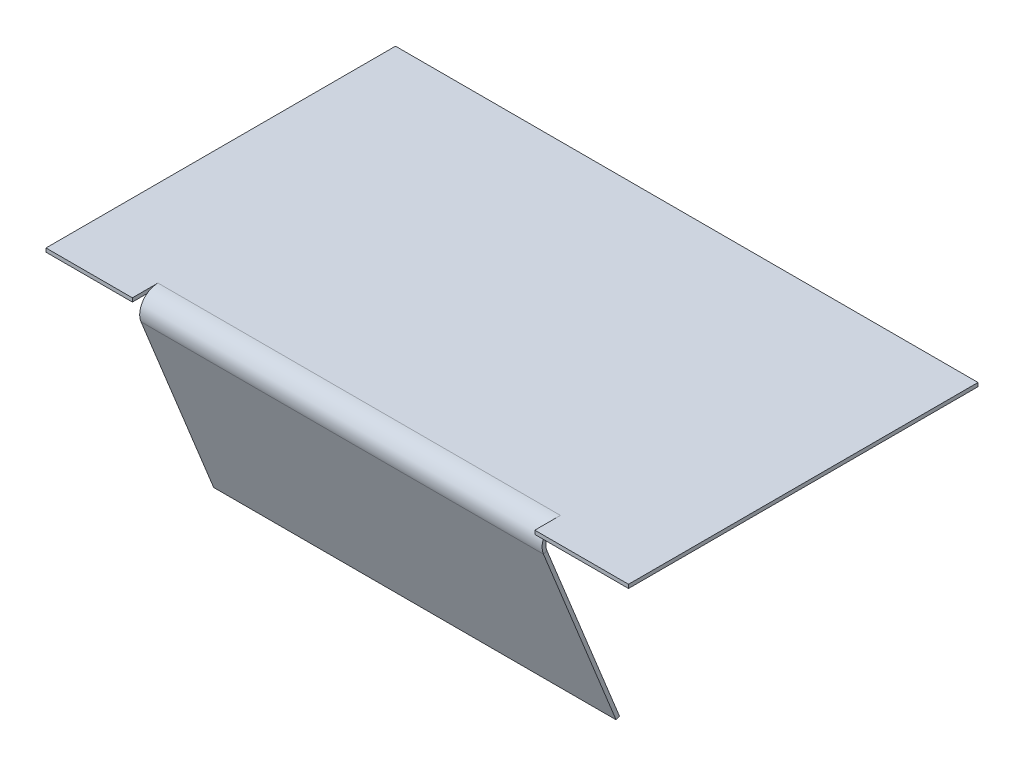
ISO-10303-21;
HEADER;
FILE_DESCRIPTION(('STEP AP214'),'2;1');
FILE_NAME('part.step','',(''),(''),'','','');
FILE_SCHEMA(('AUTOMOTIVE_DESIGN { 1 0 10303 214 1 1 1 1 }'));
ENDSEC;
DATA;
#1=APPLICATION_CONTEXT('core data for automotive mechanical design processes');
#2=APPLICATION_PROTOCOL_DEFINITION('international standard','automotive_design',2000,#1);
#3=PRODUCT_CONTEXT('',#1,'mechanical');
#4=PRODUCT('Part','Part','',(#3));
#5=PRODUCT_RELATED_PRODUCT_CATEGORY('part','',(#4));
#6=PRODUCT_DEFINITION_FORMATION('','',#4);
#7=PRODUCT_DEFINITION_CONTEXT('part definition',#1,'design');
#8=PRODUCT_DEFINITION('design','',#6,#7);
#9=PRODUCT_DEFINITION_SHAPE('','',#8);
#10=(LENGTH_UNIT() NAMED_UNIT(*) SI_UNIT(.MILLI.,.METRE.));
#11=(NAMED_UNIT(*) PLANE_ANGLE_UNIT() SI_UNIT($,.RADIAN.));
#12=(NAMED_UNIT(*) SI_UNIT($,.STERADIAN.) SOLID_ANGLE_UNIT());
#13=UNCERTAINTY_MEASURE_WITH_UNIT(LENGTH_MEASURE(1.E-05),#10,'distance_accuracy_value','');
#14=(GEOMETRIC_REPRESENTATION_CONTEXT(3) GLOBAL_UNCERTAINTY_ASSIGNED_CONTEXT((#13)) GLOBAL_UNIT_ASSIGNED_CONTEXT((#10,
#11,#12)) REPRESENTATION_CONTEXT('',''));
#15=CARTESIAN_POINT('',(0.,0.,0.));
#16=DIRECTION('',(0.,0.,1.));
#17=DIRECTION('',(1.,0.,0.));
#18=AXIS2_PLACEMENT_3D('',#15,#16,#17);
#19=CARTESIAN_POINT('',(29.6570224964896,-1.26999999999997,0.));
#20=DIRECTION('',(1.,0.,0.));
#21=DIRECTION('',(0.,0.,-1.));
#22=AXIS2_PLACEMENT_3D('',#19,#20,#21);
#23=PLANE('',#22);
#24=DIRECTION('',(0.,0.,-1.));
#25=VECTOR('',#24,1.);
#26=CARTESIAN_POINT('',(29.6570224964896,-1.26999999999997,0.));
#27=LINE('',#26,#25);
#28=CARTESIAN_POINT('',(29.6570224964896,-1.27,0.));
#29=VERTEX_POINT('',#28);
#30=CARTESIAN_POINT('',(29.6570224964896,-1.26999999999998,-4.99930461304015));
#31=VERTEX_POINT('',#30);
#32=EDGE_CURVE('E212',#29,#31,#27,.T.);
#33=ORIENTED_EDGE('',*,*,#32,.T.);
#34=CARTESIAN_POINT('',(29.6570224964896,-6.26999999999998,-8.7825439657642));
#35=DIRECTION('',(-1.,0.,0.));
#36=DIRECTION('',(0.,-1.,0.));
#37=AXIS2_PLACEMENT_3D('',#34,#35,#36);
#38=CIRCLE('',#37,6.27);
#39=CARTESIAN_POINT('',(29.6570224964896,0.,-8.7825439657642));
#40=VERTEX_POINT('',#39);
#41=EDGE_CURVE('E13',#31,#40,#38,.T.);
#42=ORIENTED_EDGE('',*,*,#41,.T.);
#43=DIRECTION('',(0.,0.,1.));
#44=VECTOR('',#43,1.);
#45=CARTESIAN_POINT('',(29.6570224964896,0.,0.));
#46=LINE('',#45,#44);
#47=CARTESIAN_POINT('',(29.6570224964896,0.,0.));
#48=VERTEX_POINT('',#47);
#49=EDGE_CURVE('E59',#40,#48,#46,.T.);
#50=ORIENTED_EDGE('',*,*,#49,.T.);
#51=DIRECTION('',(0.,1.,0.));
#52=VECTOR('',#51,1.);
#53=CARTESIAN_POINT('',(29.6570224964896,-1.26999999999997,0.));
#54=LINE('',#53,#52);
#55=EDGE_CURVE('E221',#29,#48,#54,.T.);
#56=ORIENTED_EDGE('',*,*,#55,.F.);
#57=EDGE_LOOP('',(#33,#42,#50,#56));
#58=FACE_BOUND('',#57,.T.);
#59=ADVANCED_FACE('F55',(#58),#23,.T.);
#60=CARTESIAN_POINT('',(167.834419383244,-1.27000000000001,-8.7825439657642));
#61=DIRECTION('',(-1.,0.,0.));
#62=DIRECTION('',(0.,0.,1.));
#63=AXIS2_PLACEMENT_3D('',#60,#61,#62);
#64=PLANE('',#63);
#65=DIRECTION('',(0.,0.,-1.));
#66=VECTOR('',#65,1.);
#67=CARTESIAN_POINT('',(167.834419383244,0.,0.));
#68=LINE('',#67,#66);
#69=CARTESIAN_POINT('',(167.834419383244,0.,0.));
#70=VERTEX_POINT('',#69);
#71=CARTESIAN_POINT('',(167.834419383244,0.,-8.7825439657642));
#72=VERTEX_POINT('',#71);
#73=EDGE_CURVE('E251',#70,#72,#68,.T.);
#74=ORIENTED_EDGE('',*,*,#73,.T.);
#75=CARTESIAN_POINT('',(167.834419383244,-6.27,-8.7825439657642));
#76=DIRECTION('',(-1.,0.,0.));
#77=DIRECTION('',(0.,-1.,0.));
#78=AXIS2_PLACEMENT_3D('',#75,#76,#77);
#79=CIRCLE('',#78,6.27);
#80=CARTESIAN_POINT('',(167.834419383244,-1.27000000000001,-4.99930461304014));
#81=VERTEX_POINT('',#80);
#82=EDGE_CURVE('E204',#72,#81,#79,.F.);
#83=ORIENTED_EDGE('',*,*,#82,.T.);
#84=DIRECTION('',(0.,0.,1.));
#85=VECTOR('',#84,1.);
#86=CARTESIAN_POINT('',(167.834419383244,-1.27000000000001,-8.7825439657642));
#87=LINE('',#86,#85);
#88=CARTESIAN_POINT('',(167.834419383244,-1.27,0.));
#89=VERTEX_POINT('',#88);
#90=EDGE_CURVE('E206',#81,#89,#87,.T.);
#91=ORIENTED_EDGE('',*,*,#90,.T.);
#92=DIRECTION('',(0.,1.,0.));
#93=VECTOR('',#92,1.);
#94=CARTESIAN_POINT('',(167.834419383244,-1.27,0.));
#95=LINE('',#94,#93);
#96=EDGE_CURVE('E218',#89,#70,#95,.T.);
#97=ORIENTED_EDGE('',*,*,#96,.T.);
#98=EDGE_LOOP('',(#74,#83,#91,#97));
#99=FACE_BOUND('',#98,.T.);
#100=ADVANCED_FACE('F267',(#99),#64,.T.);
#101=CARTESIAN_POINT('',(0.,-1.27,0.));
#102=DIRECTION('',(0.,0.,1.));
#103=DIRECTION('',(1.,0.,0.));
#104=AXIS2_PLACEMENT_3D('',#101,#102,#103);
#105=PLANE('',#104);
#106=DIRECTION('',(1.,0.,0.));
#107=VECTOR('',#106,1.);
#108=CARTESIAN_POINT('',(0.,-1.27,0.));
#109=LINE('',#108,#107);
#110=CARTESIAN_POINT('',(0.,-1.27,0.));
#111=VERTEX_POINT('',#110);
#112=EDGE_CURVE('E228',#111,#29,#109,.T.);
#113=ORIENTED_EDGE('',*,*,#112,.T.);
#114=ORIENTED_EDGE('',*,*,#55,.T.);
#115=DIRECTION('',(1.,0.,0.));
#116=VECTOR('',#115,1.);
#117=CARTESIAN_POINT('',(0.,0.,0.));
#118=LINE('',#117,#116);
#119=CARTESIAN_POINT('',(0.,0.,0.));
#120=VERTEX_POINT('',#119);
#121=EDGE_CURVE('E241',#120,#48,#118,.T.);
#122=ORIENTED_EDGE('',*,*,#121,.F.);
#123=DIRECTION('',(0.,1.,0.));
#124=VECTOR('',#123,1.);
#125=CARTESIAN_POINT('',(0.,-1.27,0.));
#126=LINE('',#125,#124);
#127=EDGE_CURVE('E237',#111,#120,#126,.T.);
#128=ORIENTED_EDGE('',*,*,#127,.F.);
#129=EDGE_LOOP('',(#113,#114,#122,#128));
#130=FACE_BOUND('',#129,.T.);
#131=ADVANCED_FACE('F299',(#130),#105,.T.);
#132=CARTESIAN_POINT('',(200.,0.,0.));
#133=VERTEX_POINT('',#132);
#134=EDGE_CURVE('E240',#70,#133,#118,.T.);
#135=ORIENTED_EDGE('',*,*,#134,.F.);
#136=ORIENTED_EDGE('',*,*,#96,.F.);
#137=CARTESIAN_POINT('',(200.,-1.27,0.));
#138=VERTEX_POINT('',#137);
#139=EDGE_CURVE('E226',#89,#138,#109,.T.);
#140=ORIENTED_EDGE('',*,*,#139,.T.);
#141=DIRECTION('',(0.,1.,0.));
#142=VECTOR('',#141,1.);
#143=CARTESIAN_POINT('',(200.,-1.27,0.));
#144=LINE('',#143,#142);
#145=EDGE_CURVE('E254',#138,#133,#144,.T.);
#146=ORIENTED_EDGE('',*,*,#145,.T.);
#147=EDGE_LOOP('',(#135,#136,#140,#146));
#148=FACE_BOUND('',#147,.T.);
#149=ADVANCED_FACE('F305',(#148),#105,.T.);
#150=CARTESIAN_POINT('',(0.,-1.27,0.));
#151=DIRECTION('',(0.,-1.,0.));
#152=DIRECTION('',(0.,0.,-1.));
#153=AXIS2_PLACEMENT_3D('',#150,#151,#152);
#154=PLANE('',#153);
#155=DIRECTION('',(-1.,0.,0.));
#156=VECTOR('',#155,1.);
#157=CARTESIAN_POINT('',(29.6570224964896,-1.26999999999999,-8.7825439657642));
#158=LINE('',#157,#156);
#159=CARTESIAN_POINT('',(29.6570224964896,-1.27,-8.7825439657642));
#160=VERTEX_POINT('',#159);
#161=CARTESIAN_POINT('',(167.834419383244,-1.27,-8.7825439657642));
#162=VERTEX_POINT('',#161);
#163=EDGE_CURVE('E77',#160,#162,#158,.F.);
#164=ORIENTED_EDGE('',*,*,#163,.F.);
#165=EDGE_CURVE('E72',#31,#160,#27,.T.);
#166=ORIENTED_EDGE('',*,*,#165,.F.);
#167=ORIENTED_EDGE('',*,*,#32,.F.);
#168=ORIENTED_EDGE('',*,*,#112,.F.);
#169=DIRECTION('',(0.,0.,1.));
#170=VECTOR('',#169,1.);
#171=CARTESIAN_POINT('',(0.,-1.27,0.));
#172=LINE('',#171,#170);
#173=CARTESIAN_POINT('',(0.,-1.27,-120.));
#174=VERTEX_POINT('',#173);
#175=EDGE_CURVE('E223',#174,#111,#172,.T.);
#176=ORIENTED_EDGE('',*,*,#175,.F.);
#177=DIRECTION('',(-1.,0.,0.));
#178=VECTOR('',#177,1.);
#179=CARTESIAN_POINT('',(0.,-1.27,-120.));
#180=LINE('',#179,#178);
#181=CARTESIAN_POINT('',(200.,-1.27,-120.));
#182=VERTEX_POINT('',#181);
#183=EDGE_CURVE('E234',#182,#174,#180,.T.);
#184=ORIENTED_EDGE('',*,*,#183,.F.);
#185=DIRECTION('',(0.,0.,-1.));
#186=VECTOR('',#185,1.);
#187=CARTESIAN_POINT('',(200.,-1.27,0.));
#188=LINE('',#187,#186);
#189=EDGE_CURVE('E231',#138,#182,#188,.T.);
#190=ORIENTED_EDGE('',*,*,#189,.F.);
#191=ORIENTED_EDGE('',*,*,#139,.F.);
#192=ORIENTED_EDGE('',*,*,#90,.F.);
#193=EDGE_CURVE('E215',#162,#81,#87,.T.);
#194=ORIENTED_EDGE('',*,*,#193,.F.);
#195=EDGE_LOOP('',(#164,#166,#167,#168,#176,#184,#190,#191,#192,#194));
#196=FACE_BOUND('',#195,.T.);
#197=ADVANCED_FACE('F272',(#196),#154,.T.);
#198=CARTESIAN_POINT('',(0.,0.,0.));
#199=DIRECTION('',(0.,-1.,0.));
#200=DIRECTION('',(0.,0.,-1.));
#201=AXIS2_PLACEMENT_3D('',#198,#199,#200);
#202=PLANE('',#201);
#203=ORIENTED_EDGE('',*,*,#49,.F.);
#204=DIRECTION('',(-1.,0.,0.));
#205=VECTOR('',#204,1.);
#206=CARTESIAN_POINT('',(29.6570224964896,0.,-8.7825439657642));
#207=LINE('',#206,#205);
#208=EDGE_CURVE('E158',#40,#72,#207,.F.);
#209=ORIENTED_EDGE('',*,*,#208,.T.);
#210=ORIENTED_EDGE('',*,*,#73,.F.);
#211=ORIENTED_EDGE('',*,*,#134,.T.);
#212=DIRECTION('',(0.,0.,-1.));
#213=VECTOR('',#212,1.);
#214=CARTESIAN_POINT('',(200.,0.,0.));
#215=LINE('',#214,#213);
#216=CARTESIAN_POINT('',(200.,0.,-120.));
#217=VERTEX_POINT('',#216);
#218=EDGE_CURVE('E244',#133,#217,#215,.T.);
#219=ORIENTED_EDGE('',*,*,#218,.T.);
#220=DIRECTION('',(-1.,0.,0.));
#221=VECTOR('',#220,1.);
#222=CARTESIAN_POINT('',(0.,0.,-120.));
#223=LINE('',#222,#221);
#224=CARTESIAN_POINT('',(0.,0.,-120.));
#225=VERTEX_POINT('',#224);
#226=EDGE_CURVE('E227',#217,#225,#223,.T.);
#227=ORIENTED_EDGE('',*,*,#226,.T.);
#228=DIRECTION('',(0.,0.,1.));
#229=VECTOR('',#228,1.);
#230=CARTESIAN_POINT('',(0.,0.,0.));
#231=LINE('',#230,#229);
#232=EDGE_CURVE('E214',#225,#120,#231,.T.);
#233=ORIENTED_EDGE('',*,*,#232,.T.);
#234=ORIENTED_EDGE('',*,*,#121,.T.);
#235=EDGE_LOOP('',(#203,#209,#210,#211,#219,#227,#233,#234));
#236=FACE_BOUND('',#235,.T.);
#237=ADVANCED_FACE('F265',(#236),#202,.F.);
#238=CARTESIAN_POINT('',(0.,-1.27,0.));
#239=DIRECTION('',(-1.,0.,0.));
#240=DIRECTION('',(0.,0.,1.));
#241=AXIS2_PLACEMENT_3D('',#238,#239,#240);
#242=PLANE('',#241);
#243=ORIENTED_EDGE('',*,*,#232,.F.);
#244=DIRECTION('',(0.,1.,0.));
#245=VECTOR('',#244,1.);
#246=CARTESIAN_POINT('',(0.,-1.27,-120.));
#247=LINE('',#246,#245);
#248=EDGE_CURVE('E249',#174,#225,#247,.T.);
#249=ORIENTED_EDGE('',*,*,#248,.F.);
#250=ORIENTED_EDGE('',*,*,#175,.T.);
#251=ORIENTED_EDGE('',*,*,#127,.T.);
#252=EDGE_LOOP('',(#243,#249,#250,#251));
#253=FACE_BOUND('',#252,.T.);
#254=ADVANCED_FACE('F57',(#253),#242,.T.);
#255=CARTESIAN_POINT('',(0.,-1.27,-120.));
#256=DIRECTION('',(0.,0.,-1.));
#257=DIRECTION('',(-1.,0.,0.));
#258=AXIS2_PLACEMENT_3D('',#255,#256,#257);
#259=PLANE('',#258);
#260=ORIENTED_EDGE('',*,*,#226,.F.);
#261=DIRECTION('',(0.,1.,0.));
#262=VECTOR('',#261,1.);
#263=CARTESIAN_POINT('',(200.,-1.27,-120.));
#264=LINE('',#263,#262);
#265=EDGE_CURVE('E252',#182,#217,#264,.T.);
#266=ORIENTED_EDGE('',*,*,#265,.F.);
#267=ORIENTED_EDGE('',*,*,#183,.T.);
#268=ORIENTED_EDGE('',*,*,#248,.T.);
#269=EDGE_LOOP('',(#260,#266,#267,#268));
#270=FACE_BOUND('',#269,.T.);
#271=ADVANCED_FACE('F308',(#270),#259,.T.);
#272=CARTESIAN_POINT('',(200.,-1.27,0.));
#273=DIRECTION('',(1.,0.,0.));
#274=DIRECTION('',(0.,0.,-1.));
#275=AXIS2_PLACEMENT_3D('',#272,#273,#274);
#276=PLANE('',#275);
#277=ORIENTED_EDGE('',*,*,#218,.F.);
#278=ORIENTED_EDGE('',*,*,#145,.F.);
#279=ORIENTED_EDGE('',*,*,#189,.T.);
#280=ORIENTED_EDGE('',*,*,#265,.T.);
#281=EDGE_LOOP('',(#277,#278,#279,#280));
#282=FACE_BOUND('',#281,.T.);
#283=ADVANCED_FACE('F311',(#282),#276,.T.);
#284=CARTESIAN_POINT('',(167.834419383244,-6.27,-8.7825439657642));
#285=DIRECTION('',(1.,0.,0.));
#286=DIRECTION('',(0.,1.,0.));
#287=AXIS2_PLACEMENT_3D('',#284,#285,#286);
#288=PLANE('',#287);
#289=CARTESIAN_POINT('',(167.834419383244,-6.27,-8.7825439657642));
#290=DIRECTION('',(-1.,0.,0.));
#291=DIRECTION('',(0.,-1.,0.));
#292=AXIS2_PLACEMENT_3D('',#289,#290,#291);
#293=CIRCLE('',#292,4.99999999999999);
#294=CARTESIAN_POINT('',(167.834419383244,-8.14303296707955,-4.14662469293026));
#295=VERTEX_POINT('',#294);
#296=EDGE_CURVE('E159',#162,#295,#293,.F.);
#297=ORIENTED_EDGE('',*,*,#296,.F.);
#298=ORIENTED_EDGE('',*,*,#193,.T.);
#299=CARTESIAN_POINT('',(167.834419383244,-8.61878334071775,-2.96910119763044));
#300=VERTEX_POINT('',#299);
#301=EDGE_CURVE('E203',#81,#300,#79,.F.);
#302=ORIENTED_EDGE('',*,*,#301,.T.);
#303=DIRECTION('',(0.,-0.374606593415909,0.927183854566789));
#304=VECTOR('',#303,1.);
#305=CARTESIAN_POINT('',(167.834419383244,-8.61878334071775,-2.96910119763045));
#306=LINE('',#305,#304);
#307=EDGE_CURVE('E200',#295,#300,#306,.T.);
#308=ORIENTED_EDGE('',*,*,#307,.F.);
#309=EDGE_LOOP('',(#297,#298,#302,#308));
#310=FACE_BOUND('',#309,.T.);
#311=ADVANCED_FACE('F271',(#310),#288,.T.);
#312=CARTESIAN_POINT('',(29.6570224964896,-6.26999999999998,-8.7825439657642));
#313=DIRECTION('',(1.,0.,0.));
#314=DIRECTION('',(0.,1.,0.));
#315=AXIS2_PLACEMENT_3D('',#312,#313,#314);
#316=PLANE('',#315);
#317=CARTESIAN_POINT('',(29.6570224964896,-8.61878334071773,-2.96910119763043));
#318=VERTEX_POINT('',#317);
#319=EDGE_CURVE('E65',#318,#31,#38,.T.);
#320=ORIENTED_EDGE('',*,*,#319,.T.);
#321=ORIENTED_EDGE('',*,*,#165,.T.);
#322=CARTESIAN_POINT('',(29.6570224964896,-6.26999999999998,-8.7825439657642));
#323=DIRECTION('',(-1.,0.,0.));
#324=DIRECTION('',(0.,-1.,0.));
#325=AXIS2_PLACEMENT_3D('',#322,#323,#324);
#326=CIRCLE('',#325,4.99999999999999);
#327=CARTESIAN_POINT('',(29.6570224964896,-8.14303296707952,-4.14662469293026));
#328=VERTEX_POINT('',#327);
#329=EDGE_CURVE('E165',#328,#160,#326,.T.);
#330=ORIENTED_EDGE('',*,*,#329,.F.);
#331=DIRECTION('',(0.,-0.374606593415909,0.927183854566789));
#332=VECTOR('',#331,1.);
#333=CARTESIAN_POINT('',(29.6570224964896,-8.14303296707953,-4.14662469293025));
#334=LINE('',#333,#332);
#335=EDGE_CURVE('E162',#328,#318,#334,.T.);
#336=ORIENTED_EDGE('',*,*,#335,.T.);
#337=EDGE_LOOP('',(#320,#321,#330,#336));
#338=FACE_BOUND('',#337,.T.);
#339=ADVANCED_FACE('F163',(#338),#316,.F.);
#340=CARTESIAN_POINT('',(29.6570224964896,-6.26999999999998,-8.7825439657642));
#341=DIRECTION('',(-1.,0.,0.));
#342=DIRECTION('',(0.,-0.374606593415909,0.927183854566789));
#343=AXIS2_PLACEMENT_3D('',#340,#341,#342);
#344=CYLINDRICAL_SURFACE('',#343,6.27);
#345=ORIENTED_EDGE('',*,*,#208,.F.);
#346=ORIENTED_EDGE('',*,*,#41,.F.);
#347=ORIENTED_EDGE('',*,*,#319,.F.);
#348=DIRECTION('',(-1.,0.,0.));
#349=VECTOR('',#348,1.);
#350=CARTESIAN_POINT('',(0.,-8.61878334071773,-2.96910119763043));
#351=LINE('',#350,#349);
#352=EDGE_CURVE('E155',#300,#318,#351,.T.);
#353=ORIENTED_EDGE('',*,*,#352,.F.);
#354=ORIENTED_EDGE('',*,*,#301,.F.);
#355=ORIENTED_EDGE('',*,*,#82,.F.);
#356=EDGE_LOOP('',(#345,#346,#347,#353,#354,#355));
#357=FACE_BOUND('',#356,.T.);
#358=ADVANCED_FACE('F152',(#357),#344,.T.);
#359=CARTESIAN_POINT('',(29.6570224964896,-6.26999999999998,-8.7825439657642));
#360=DIRECTION('',(-1.,0.,0.));
#361=DIRECTION('',(0.,-0.374606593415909,0.927183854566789));
#362=AXIS2_PLACEMENT_3D('',#359,#360,#361);
#363=CYLINDRICAL_SURFACE('',#362,4.99999999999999);
#364=ORIENTED_EDGE('',*,*,#163,.T.);
#365=ORIENTED_EDGE('',*,*,#296,.T.);
#366=DIRECTION('',(1.,0.,0.));
#367=VECTOR('',#366,1.);
#368=CARTESIAN_POINT('',(167.834419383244,-8.14303296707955,-4.14662469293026));
#369=LINE('',#368,#367);
#370=EDGE_CURVE('E170',#295,#328,#369,.F.);
#371=ORIENTED_EDGE('',*,*,#370,.T.);
#372=ORIENTED_EDGE('',*,*,#329,.T.);
#373=EDGE_LOOP('',(#364,#365,#371,#372));
#374=FACE_BOUND('',#373,.T.);
#375=ADVANCED_FACE('F275',(#374),#363,.F.);
#376=CARTESIAN_POINT('',(29.6570224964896,-1.74575037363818,-0.192215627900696));
#377=DIRECTION('',(-1.,0.,0.));
#378=DIRECTION('',(0.,-1.,0.));
#379=AXIS2_PLACEMENT_3D('',#376,#377,#378);
#380=PLANE('',#379);
#381=DIRECTION('',(0.,0.927183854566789,0.374606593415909));
#382=VECTOR('',#381,1.);
#383=CARTESIAN_POINT('',(29.6570224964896,-1.74575037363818,-0.192215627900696));
#384=LINE('',#383,#382);
#385=CARTESIAN_POINT('',(29.6570224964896,-70.3573556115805,-27.913103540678));
#386=VERTEX_POINT('',#385);
#387=EDGE_CURVE('E177',#386,#318,#384,.T.);
#388=ORIENTED_EDGE('',*,*,#387,.T.);
#389=ORIENTED_EDGE('',*,*,#335,.F.);
#390=DIRECTION('',(0.,-0.927183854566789,-0.374606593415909));
#391=VECTOR('',#390,1.);
#392=CARTESIAN_POINT('',(29.6570224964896,-0.178219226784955,-0.928631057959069));
#393=LINE('',#392,#391);
#394=CARTESIAN_POINT('',(29.6570224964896,-69.8816052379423,-29.0906270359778));
#395=VERTEX_POINT('',#394);
#396=EDGE_CURVE('E193',#395,#328,#393,.F.);
#397=ORIENTED_EDGE('',*,*,#396,.F.);
#398=DIRECTION('',(0.,0.374606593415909,-0.927183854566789));
#399=VECTOR('',#398,1.);
#400=CARTESIAN_POINT('',(29.6570224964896,-70.3573556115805,-27.913103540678));
#401=LINE('',#400,#399);
#402=EDGE_CURVE('E182',#386,#395,#401,.T.);
#403=ORIENTED_EDGE('',*,*,#402,.F.);
#404=EDGE_LOOP('',(#388,#389,#397,#403));
#405=FACE_BOUND('',#404,.T.);
#406=ADVANCED_FACE('F181',(#405),#380,.T.);
#407=CARTESIAN_POINT('',(167.834419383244,-70.3573556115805,-27.913103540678));
#408=DIRECTION('',(1.,0.,0.));
#409=DIRECTION('',(0.,0.,-1.));
#410=AXIS2_PLACEMENT_3D('',#407,#408,#409);
#411=PLANE('',#410);
#412=DIRECTION('',(0.,0.927183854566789,0.374606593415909));
#413=VECTOR('',#412,1.);
#414=CARTESIAN_POINT('',(167.834419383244,-0.178219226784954,-0.928631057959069));
#415=LINE('',#414,#413);
#416=CARTESIAN_POINT('',(167.834419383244,-69.8816052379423,-29.0906270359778));
#417=VERTEX_POINT('',#416);
#418=EDGE_CURVE('E179',#295,#417,#415,.F.);
#419=ORIENTED_EDGE('',*,*,#418,.F.);
#420=ORIENTED_EDGE('',*,*,#307,.T.);
#421=DIRECTION('',(0.,-0.927183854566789,-0.374606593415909));
#422=VECTOR('',#421,1.);
#423=CARTESIAN_POINT('',(167.834419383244,-70.3573556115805,-27.913103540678));
#424=LINE('',#423,#422);
#425=CARTESIAN_POINT('',(167.834419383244,-70.3573556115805,-27.913103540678));
#426=VERTEX_POINT('',#425);
#427=EDGE_CURVE('E178',#300,#426,#424,.T.);
#428=ORIENTED_EDGE('',*,*,#427,.T.);
#429=DIRECTION('',(0.,0.374606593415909,-0.927183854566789));
#430=VECTOR('',#429,1.);
#431=CARTESIAN_POINT('',(167.834419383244,-70.3573556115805,-27.913103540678));
#432=LINE('',#431,#430);
#433=EDGE_CURVE('E184',#426,#417,#432,.T.);
#434=ORIENTED_EDGE('',*,*,#433,.T.);
#435=EDGE_LOOP('',(#419,#420,#428,#434));
#436=FACE_BOUND('',#435,.T.);
#437=ADVANCED_FACE('F281',(#436),#411,.T.);
#438=CARTESIAN_POINT('',(0.,-0.653969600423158,0.248892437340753));
#439=DIRECTION('',(0.,-0.374606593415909,0.927183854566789));
#440=DIRECTION('',(0.,-0.927183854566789,-0.374606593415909));
#441=AXIS2_PLACEMENT_3D('',#438,#439,#440);
#442=PLANE('',#441);
#443=ORIENTED_EDGE('',*,*,#427,.F.);
#444=ORIENTED_EDGE('',*,*,#352,.T.);
#445=ORIENTED_EDGE('',*,*,#387,.F.);
#446=DIRECTION('',(-1.,0.,0.));
#447=VECTOR('',#446,1.);
#448=CARTESIAN_POINT('',(29.6570224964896,-70.3573556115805,-27.913103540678));
#449=LINE('',#448,#447);
#450=EDGE_CURVE('E185',#426,#386,#449,.T.);
#451=ORIENTED_EDGE('',*,*,#450,.F.);
#452=EDGE_LOOP('',(#443,#444,#445,#451));
#453=FACE_BOUND('',#452,.T.);
#454=ADVANCED_FACE('F175',(#453),#442,.T.);
#455=CARTESIAN_POINT('',(0.,-0.178219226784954,-0.928631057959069));
#456=DIRECTION('',(0.,-0.374606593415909,0.927183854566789));
#457=DIRECTION('',(0.,-0.927183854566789,-0.374606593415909));
#458=AXIS2_PLACEMENT_3D('',#455,#456,#457);
#459=PLANE('',#458);
#460=ORIENTED_EDGE('',*,*,#370,.F.);
#461=ORIENTED_EDGE('',*,*,#418,.T.);
#462=DIRECTION('',(1.,0.,0.));
#463=VECTOR('',#462,1.);
#464=CARTESIAN_POINT('',(0.,-69.8816052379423,-29.0906270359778));
#465=LINE('',#464,#463);
#466=EDGE_CURVE('E195',#417,#395,#465,.F.);
#467=ORIENTED_EDGE('',*,*,#466,.T.);
#468=ORIENTED_EDGE('',*,*,#396,.T.);
#469=EDGE_LOOP('',(#460,#461,#467,#468));
#470=FACE_BOUND('',#469,.T.);
#471=ADVANCED_FACE('F279',(#470),#459,.F.);
#472=CARTESIAN_POINT('',(29.6570224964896,-70.3573556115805,-27.913103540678));
#473=DIRECTION('',(0.,-0.927183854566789,-0.374606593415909));
#474=DIRECTION('',(0.,0.374606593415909,-0.927183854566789));
#475=AXIS2_PLACEMENT_3D('',#472,#473,#474);
#476=PLANE('',#475);
#477=ORIENTED_EDGE('',*,*,#466,.F.);
#478=ORIENTED_EDGE('',*,*,#433,.F.);
#479=ORIENTED_EDGE('',*,*,#450,.T.);
#480=ORIENTED_EDGE('',*,*,#402,.T.);
#481=EDGE_LOOP('',(#477,#478,#479,#480));
#482=FACE_BOUND('',#481,.T.);
#483=ADVANCED_FACE('F285',(#482),#476,.T.);
#484=CLOSED_SHELL('',(#59,#100,#131,#149,#197,#237,#254,#271,#283,#311,#339,#358,#375,#406,#437,
#454,#471,#483));
#485=MANIFOLD_SOLID_BREP('B2',#484);
#486=ADVANCED_BREP_SHAPE_REPRESENTATION('',(#18,#485),#14);
#487=SHAPE_DEFINITION_REPRESENTATION(#9,#486);
ENDSEC;
END-ISO-10303-21;
